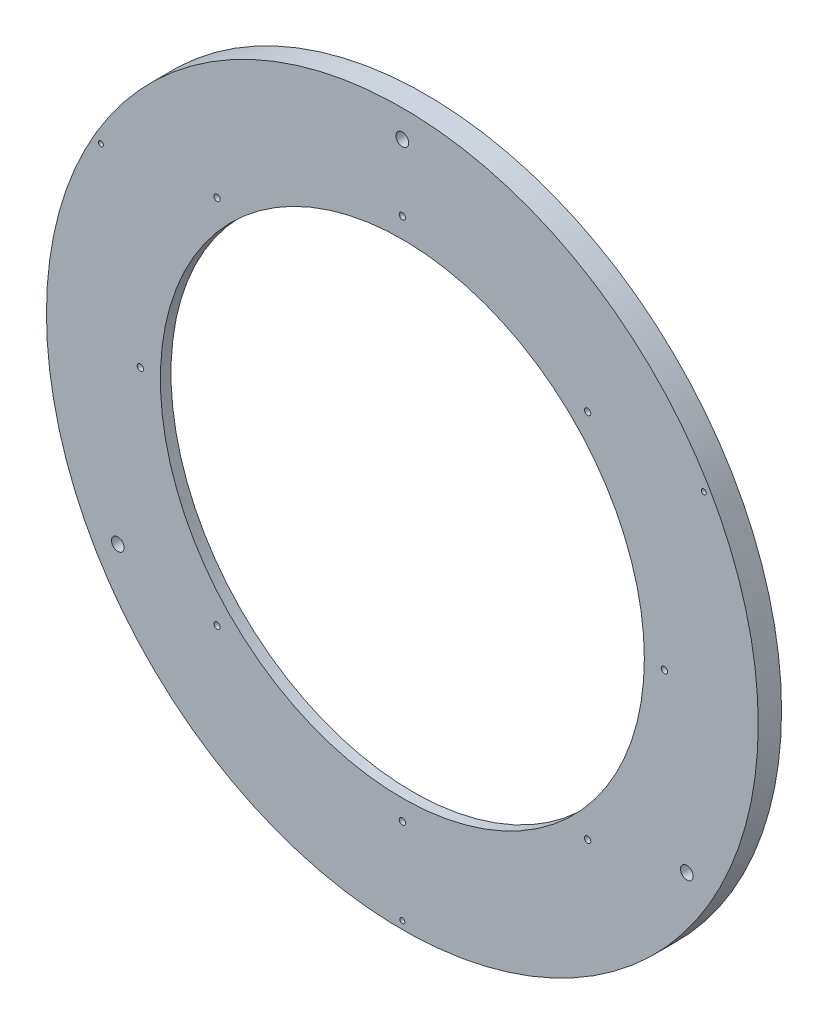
ISO-10303-21;
HEADER;
FILE_DESCRIPTION(('STEP AP214'),'2;1');
FILE_NAME('part.step','',(''),(''),'','','');
FILE_SCHEMA(('AUTOMOTIVE_DESIGN { 1 0 10303 214 1 1 1 1 }'));
ENDSEC;
DATA;
#1=APPLICATION_CONTEXT('core data for automotive mechanical design processes');
#2=APPLICATION_PROTOCOL_DEFINITION('international standard','automotive_design',2000,#1);
#3=PRODUCT_CONTEXT('',#1,'mechanical');
#4=PRODUCT('Part','Part','',(#3));
#5=PRODUCT_RELATED_PRODUCT_CATEGORY('part','',(#4));
#6=PRODUCT_DEFINITION_FORMATION('','',#4);
#7=PRODUCT_DEFINITION_CONTEXT('part definition',#1,'design');
#8=PRODUCT_DEFINITION('design','',#6,#7);
#9=PRODUCT_DEFINITION_SHAPE('','',#8);
#10=(LENGTH_UNIT() NAMED_UNIT(*) SI_UNIT(.MILLI.,.METRE.));
#11=(NAMED_UNIT(*) PLANE_ANGLE_UNIT() SI_UNIT($,.RADIAN.));
#12=(NAMED_UNIT(*) SI_UNIT($,.STERADIAN.) SOLID_ANGLE_UNIT());
#13=UNCERTAINTY_MEASURE_WITH_UNIT(LENGTH_MEASURE(1.E-05),#10,'distance_accuracy_value','');
#14=(GEOMETRIC_REPRESENTATION_CONTEXT(3) GLOBAL_UNCERTAINTY_ASSIGNED_CONTEXT((#13)) GLOBAL_UNIT_ASSIGNED_CONTEXT((#10,
#11,#12)) REPRESENTATION_CONTEXT('',''));
#15=CARTESIAN_POINT('',(0.,0.,0.));
#16=DIRECTION('',(0.,0.,1.));
#17=DIRECTION('',(1.,0.,0.));
#18=AXIS2_PLACEMENT_3D('',#15,#16,#17);
#19=CARTESIAN_POINT('',(0.,0.,0.));
#20=DIRECTION('',(0.,0.,1.));
#21=DIRECTION('',(1.,0.,0.));
#22=AXIS2_PLACEMENT_3D('',#19,#20,#21);
#23=CYLINDRICAL_SURFACE('',#22,196.453125);
#24=CARTESIAN_POINT('',(0.,0.,0.));
#25=DIRECTION('',(0.,0.,1.));
#26=DIRECTION('',(1.,0.,0.));
#27=AXIS2_PLACEMENT_3D('',#24,#25,#26);
#28=CIRCLE('',#27,196.453125);
#29=CARTESIAN_POINT('',(196.453125,0.,0.));
#30=VERTEX_POINT('',#29);
#31=EDGE_CURVE('E10',#30,#30,#28,.T.);
#32=ORIENTED_EDGE('',*,*,#31,.T.);
#33=EDGE_LOOP('',(#32));
#34=FACE_BOUND('',#33,.T.);
#35=CARTESIAN_POINT('',(0.,0.,-8.636));
#36=DIRECTION('',(0.,0.,1.));
#37=DIRECTION('',(1.,0.,0.));
#38=AXIS2_PLACEMENT_3D('',#35,#36,#37);
#39=CIRCLE('',#38,196.453125);
#40=CARTESIAN_POINT('',(196.453125,0.,-8.636));
#41=VERTEX_POINT('',#40);
#42=EDGE_CURVE('E61',#41,#41,#39,.T.);
#43=ORIENTED_EDGE('',*,*,#42,.F.);
#44=EDGE_LOOP('',(#43));
#45=FACE_BOUND('',#44,.T.);
#46=ADVANCED_FACE('F33',(#34,#45),#23,.F.);
#47=CARTESIAN_POINT('',(196.453125,0.,0.));
#48=DIRECTION('',(0.,0.,1.));
#49=DIRECTION('',(1.,0.,0.));
#50=AXIS2_PLACEMENT_3D('',#47,#48,#49);
#51=PLANE('',#50);
#52=CARTESIAN_POINT('',(0.,-282.575,0.));
#53=DIRECTION('',(0.,0.,-1.));
#54=DIRECTION('',(-1.,0.,0.));
#55=AXIS2_PLACEMENT_3D('',#52,#53,#54);
#56=CIRCLE('',#55,2.0193);
#57=CARTESIAN_POINT('',(-2.0193,-282.575,0.));
#58=VERTEX_POINT('',#57);
#59=EDGE_CURVE('E142',#58,#58,#56,.T.);
#60=ORIENTED_EDGE('',*,*,#59,.T.);
#61=EDGE_LOOP('',(#60));
#62=FACE_BOUND('',#61,.T.);
#63=CARTESIAN_POINT('',(-244.717128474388,141.287499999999,0.));
#64=DIRECTION('',(0.,0.,-1.));
#65=DIRECTION('',(-1.,0.,0.));
#66=AXIS2_PLACEMENT_3D('',#63,#64,#65);
#67=CIRCLE('',#66,2.0193);
#68=CARTESIAN_POINT('',(-246.736428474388,141.287499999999,0.));
#69=VERTEX_POINT('',#68);
#70=EDGE_CURVE('E136',#69,#69,#67,.T.);
#71=ORIENTED_EDGE('',*,*,#70,.T.);
#72=EDGE_LOOP('',(#71));
#73=FACE_BOUND('',#72,.T.);
#74=CARTESIAN_POINT('',(244.717128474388,141.287499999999,0.));
#75=DIRECTION('',(0.,0.,-1.));
#76=DIRECTION('',(-1.,0.,0.));
#77=AXIS2_PLACEMENT_3D('',#74,#75,#76);
#78=CIRCLE('',#77,2.0193);
#79=CARTESIAN_POINT('',(242.697828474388,141.287499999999,0.));
#80=VERTEX_POINT('',#79);
#81=EDGE_CURVE('E130',#80,#80,#78,.T.);
#82=ORIENTED_EDGE('',*,*,#81,.T.);
#83=EDGE_LOOP('',(#82));
#84=FACE_BOUND('',#83,.T.);
#85=CARTESIAN_POINT('',(0.,266.7,0.));
#86=DIRECTION('',(0.,0.,-1.));
#87=DIRECTION('',(-1.,0.,0.));
#88=AXIS2_PLACEMENT_3D('',#85,#86,#87);
#89=CIRCLE('',#88,5.15873999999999);
#90=CARTESIAN_POINT('',(-5.15873999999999,266.7,0.));
#91=VERTEX_POINT('',#90);
#92=EDGE_CURVE('E124',#91,#91,#89,.T.);
#93=ORIENTED_EDGE('',*,*,#92,.T.);
#94=EDGE_LOOP('',(#93));
#95=FACE_BOUND('',#94,.T.);
#96=CARTESIAN_POINT('',(-230.96897518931,-133.349999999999,0.));
#97=DIRECTION('',(0.,0.,-1.));
#98=DIRECTION('',(-1.,0.,0.));
#99=AXIS2_PLACEMENT_3D('',#96,#97,#98);
#100=CIRCLE('',#99,5.15873999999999);
#101=CARTESIAN_POINT('',(-236.12771518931,-133.349999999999,0.));
#102=VERTEX_POINT('',#101);
#103=EDGE_CURVE('E118',#102,#102,#100,.T.);
#104=ORIENTED_EDGE('',*,*,#103,.T.);
#105=EDGE_LOOP('',(#104));
#106=FACE_BOUND('',#105,.T.);
#107=CARTESIAN_POINT('',(230.96897518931,-133.349999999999,0.));
#108=DIRECTION('',(0.,0.,-1.));
#109=DIRECTION('',(-1.,0.,0.));
#110=AXIS2_PLACEMENT_3D('',#107,#108,#109);
#111=CIRCLE('',#110,5.15873999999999);
#112=CARTESIAN_POINT('',(225.81023518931,-133.349999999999,0.));
#113=VERTEX_POINT('',#112);
#114=EDGE_CURVE('E112',#113,#113,#111,.T.);
#115=ORIENTED_EDGE('',*,*,#114,.T.);
#116=EDGE_LOOP('',(#115));
#117=FACE_BOUND('',#116,.T.);
#118=CARTESIAN_POINT('',(150.419290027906,150.41929002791,0.));
#119=DIRECTION('',(0.,0.,-1.));
#120=DIRECTION('',(-1.,0.,0.));
#121=AXIS2_PLACEMENT_3D('',#118,#119,#120);
#122=CIRCLE('',#121,2.55269999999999);
#123=CARTESIAN_POINT('',(147.866590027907,150.41929002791,0.));
#124=VERTEX_POINT('',#123);
#125=EDGE_CURVE('E106',#124,#124,#122,.T.);
#126=ORIENTED_EDGE('',*,*,#125,.T.);
#127=EDGE_LOOP('',(#126));
#128=FACE_BOUND('',#127,.T.);
#129=CARTESIAN_POINT('',(212.725,2.22817610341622E-12,0.));
#130=DIRECTION('',(0.,0.,-1.));
#131=DIRECTION('',(-1.,0.,0.));
#132=AXIS2_PLACEMENT_3D('',#129,#130,#131);
#133=CIRCLE('',#132,2.55269999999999);
#134=CARTESIAN_POINT('',(210.1723,2.22817610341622E-12,0.));
#135=VERTEX_POINT('',#134);
#136=EDGE_CURVE('E100',#135,#135,#133,.T.);
#137=ORIENTED_EDGE('',*,*,#136,.T.);
#138=EDGE_LOOP('',(#137));
#139=FACE_BOUND('',#138,.T.);
#140=CARTESIAN_POINT('',(150.41929002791,-150.419290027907,0.));
#141=DIRECTION('',(0.,0.,-1.));
#142=DIRECTION('',(-1.,0.,0.));
#143=AXIS2_PLACEMENT_3D('',#140,#141,#142);
#144=CIRCLE('',#143,2.55269999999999);
#145=CARTESIAN_POINT('',(147.86659002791,-150.419290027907,0.));
#146=VERTEX_POINT('',#145);
#147=EDGE_CURVE('E94',#146,#146,#144,.T.);
#148=ORIENTED_EDGE('',*,*,#147,.T.);
#149=EDGE_LOOP('',(#148));
#150=FACE_BOUND('',#149,.T.);
#151=CARTESIAN_POINT('',(0.,-212.725,0.));
#152=DIRECTION('',(0.,0.,-1.));
#153=DIRECTION('',(-1.,0.,0.));
#154=AXIS2_PLACEMENT_3D('',#151,#152,#153);
#155=CIRCLE('',#154,2.5527);
#156=CARTESIAN_POINT('',(-2.5527,-212.725,0.));
#157=VERTEX_POINT('',#156);
#158=EDGE_CURVE('E88',#157,#157,#155,.T.);
#159=ORIENTED_EDGE('',*,*,#158,.T.);
#160=EDGE_LOOP('',(#159));
#161=FACE_BOUND('',#160,.T.);
#162=CARTESIAN_POINT('',(-150.419290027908,-150.419290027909,0.));
#163=DIRECTION('',(0.,0.,-1.));
#164=DIRECTION('',(-1.,0.,0.));
#165=AXIS2_PLACEMENT_3D('',#162,#163,#164);
#166=CIRCLE('',#165,2.55269999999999);
#167=CARTESIAN_POINT('',(-152.971990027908,-150.419290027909,0.));
#168=VERTEX_POINT('',#167);
#169=EDGE_CURVE('E82',#168,#168,#166,.T.);
#170=ORIENTED_EDGE('',*,*,#169,.T.);
#171=EDGE_LOOP('',(#170));
#172=FACE_BOUND('',#171,.T.);
#173=CARTESIAN_POINT('',(-212.725,-7.42725367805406E-13,0.));
#174=DIRECTION('',(0.,0.,-1.));
#175=DIRECTION('',(-1.,0.,0.));
#176=AXIS2_PLACEMENT_3D('',#173,#174,#175);
#177=CIRCLE('',#176,2.55269999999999);
#178=CARTESIAN_POINT('',(-215.2777,-7.42725367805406E-13,0.));
#179=VERTEX_POINT('',#178);
#180=EDGE_CURVE('E76',#179,#179,#177,.T.);
#181=ORIENTED_EDGE('',*,*,#180,.T.);
#182=EDGE_LOOP('',(#181));
#183=FACE_BOUND('',#182,.T.);
#184=CARTESIAN_POINT('',(-150.419290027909,150.419290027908,0.));
#185=DIRECTION('',(0.,0.,-1.));
#186=DIRECTION('',(-1.,0.,0.));
#187=AXIS2_PLACEMENT_3D('',#184,#185,#186);
#188=CIRCLE('',#187,2.55269999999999);
#189=CARTESIAN_POINT('',(-152.971990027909,150.419290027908,0.));
#190=VERTEX_POINT('',#189);
#191=EDGE_CURVE('E70',#190,#190,#188,.T.);
#192=ORIENTED_EDGE('',*,*,#191,.T.);
#193=EDGE_LOOP('',(#192));
#194=FACE_BOUND('',#193,.T.);
#195=CARTESIAN_POINT('',(0.,212.725,0.));
#196=DIRECTION('',(0.,0.,-1.));
#197=DIRECTION('',(-1.,0.,0.));
#198=AXIS2_PLACEMENT_3D('',#195,#196,#197);
#199=CIRCLE('',#198,2.5527);
#200=CARTESIAN_POINT('',(-2.5527,212.725,0.));
#201=VERTEX_POINT('',#200);
#202=EDGE_CURVE('E64',#201,#201,#199,.T.);
#203=ORIENTED_EDGE('',*,*,#202,.T.);
#204=EDGE_LOOP('',(#203));
#205=FACE_BOUND('',#204,.T.);
#206=CARTESIAN_POINT('',(0.,0.,0.));
#207=DIRECTION('',(0.,0.,1.));
#208=DIRECTION('',(1.,0.,0.));
#209=AXIS2_PLACEMENT_3D('',#206,#207,#208);
#210=CIRCLE('',#209,288.925);
#211=CARTESIAN_POINT('',(288.925,0.,0.));
#212=VERTEX_POINT('',#211);
#213=EDGE_CURVE('E39',#212,#212,#210,.T.);
#214=ORIENTED_EDGE('',*,*,#213,.T.);
#215=EDGE_LOOP('',(#214));
#216=FACE_BOUND('',#215,.T.);
#217=ORIENTED_EDGE('',*,*,#31,.F.);
#218=EDGE_LOOP('',(#217));
#219=FACE_BOUND('',#218,.T.);
#220=ADVANCED_FACE('F167',(#62,#73,#84,#95,#106,#117,#128,#139,#150,#161,#172,#183,#194,#205,
#216,#219),#51,.T.);
#221=CARTESIAN_POINT('',(0.,0.,0.));
#222=DIRECTION('',(0.,0.,1.));
#223=DIRECTION('',(1.,0.,0.));
#224=AXIS2_PLACEMENT_3D('',#221,#222,#223);
#225=CYLINDRICAL_SURFACE('',#224,288.925);
#226=CARTESIAN_POINT('',(0.,0.,-18.923));
#227=DIRECTION('',(0.,0.,1.));
#228=DIRECTION('',(1.,0.,0.));
#229=AXIS2_PLACEMENT_3D('',#226,#227,#228);
#230=CIRCLE('',#229,288.925);
#231=CARTESIAN_POINT('',(288.925,0.,-18.923));
#232=VERTEX_POINT('',#231);
#233=EDGE_CURVE('E43',#232,#232,#230,.T.);
#234=ORIENTED_EDGE('',*,*,#233,.T.);
#235=EDGE_LOOP('',(#234));
#236=FACE_BOUND('',#235,.T.);
#237=ORIENTED_EDGE('',*,*,#213,.F.);
#238=EDGE_LOOP('',(#237));
#239=FACE_BOUND('',#238,.T.);
#240=ADVANCED_FACE('F155',(#236,#239),#225,.T.);
#241=CARTESIAN_POINT('',(288.925,0.,-18.923));
#242=DIRECTION('',(0.,0.,-1.));
#243=DIRECTION('',(-1.,0.,0.));
#244=AXIS2_PLACEMENT_3D('',#241,#242,#243);
#245=PLANE('',#244);
#246=CARTESIAN_POINT('',(0.,-282.575,-18.923));
#247=DIRECTION('',(0.,0.,-1.));
#248=DIRECTION('',(-1.,0.,0.));
#249=AXIS2_PLACEMENT_3D('',#246,#247,#248);
#250=CIRCLE('',#249,2.01929999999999);
#251=CARTESIAN_POINT('',(-2.01929999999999,-282.575,-18.923));
#252=VERTEX_POINT('',#251);
#253=EDGE_CURVE('E145',#252,#252,#250,.T.);
#254=ORIENTED_EDGE('',*,*,#253,.F.);
#255=EDGE_LOOP('',(#254));
#256=FACE_BOUND('',#255,.T.);
#257=CARTESIAN_POINT('',(-244.717128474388,141.287499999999,-18.923));
#258=DIRECTION('',(0.,0.,-1.));
#259=DIRECTION('',(-1.,0.,0.));
#260=AXIS2_PLACEMENT_3D('',#257,#258,#259);
#261=CIRCLE('',#260,2.01929999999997);
#262=CARTESIAN_POINT('',(-246.736428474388,141.287499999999,-18.923));
#263=VERTEX_POINT('',#262);
#264=EDGE_CURVE('E139',#263,#263,#261,.T.);
#265=ORIENTED_EDGE('',*,*,#264,.F.);
#266=EDGE_LOOP('',(#265));
#267=FACE_BOUND('',#266,.T.);
#268=CARTESIAN_POINT('',(244.717128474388,141.287499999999,-18.923));
#269=DIRECTION('',(0.,0.,-1.));
#270=DIRECTION('',(-1.,0.,0.));
#271=AXIS2_PLACEMENT_3D('',#268,#269,#270);
#272=CIRCLE('',#271,2.01929999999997);
#273=CARTESIAN_POINT('',(242.697828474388,141.287499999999,-18.923));
#274=VERTEX_POINT('',#273);
#275=EDGE_CURVE('E133',#274,#274,#272,.T.);
#276=ORIENTED_EDGE('',*,*,#275,.F.);
#277=EDGE_LOOP('',(#276));
#278=FACE_BOUND('',#277,.T.);
#279=CARTESIAN_POINT('',(0.,0.,-18.923));
#280=DIRECTION('',(0.,0.,1.));
#281=DIRECTION('',(1.,0.,0.));
#282=AXIS2_PLACEMENT_3D('',#279,#280,#281);
#283=CIRCLE('',#282,276.225);
#284=CARTESIAN_POINT('',(276.225,0.,-18.923));
#285=VERTEX_POINT('',#284);
#286=EDGE_CURVE('E47',#285,#285,#283,.T.);
#287=ORIENTED_EDGE('',*,*,#286,.T.);
#288=EDGE_LOOP('',(#287));
#289=FACE_BOUND('',#288,.T.);
#290=ORIENTED_EDGE('',*,*,#233,.F.);
#291=EDGE_LOOP('',(#290));
#292=FACE_BOUND('',#291,.T.);
#293=ADVANCED_FACE('F151',(#256,#267,#278,#289,#292),#245,.T.);
#294=CARTESIAN_POINT('',(0.,0.,0.));
#295=DIRECTION('',(0.,0.,1.));
#296=DIRECTION('',(1.,0.,0.));
#297=AXIS2_PLACEMENT_3D('',#294,#295,#296);
#298=CYLINDRICAL_SURFACE('',#297,276.225);
#299=CARTESIAN_POINT('',(0.,0.,-25.146));
#300=DIRECTION('',(0.,0.,1.));
#301=DIRECTION('',(1.,0.,0.));
#302=AXIS2_PLACEMENT_3D('',#299,#300,#301);
#303=CIRCLE('',#302,276.225);
#304=CARTESIAN_POINT('',(276.225,0.,-25.146));
#305=VERTEX_POINT('',#304);
#306=EDGE_CURVE('E52',#305,#305,#303,.T.);
#307=ORIENTED_EDGE('',*,*,#306,.T.);
#308=EDGE_LOOP('',(#307));
#309=FACE_BOUND('',#308,.T.);
#310=ORIENTED_EDGE('',*,*,#286,.F.);
#311=EDGE_LOOP('',(#310));
#312=FACE_BOUND('',#311,.T.);
#313=ADVANCED_FACE('F154',(#309,#312),#298,.T.);
#314=CARTESIAN_POINT('',(276.225,0.,-25.146));
#315=DIRECTION('',(0.,0.,-1.));
#316=DIRECTION('',(-1.,0.,0.));
#317=AXIS2_PLACEMENT_3D('',#314,#315,#316);
#318=PLANE('',#317);
#319=CARTESIAN_POINT('',(0.,266.7,-25.146));
#320=DIRECTION('',(0.,0.,-1.));
#321=DIRECTION('',(-1.,0.,0.));
#322=AXIS2_PLACEMENT_3D('',#319,#320,#321);
#323=CIRCLE('',#322,5.15873999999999);
#324=CARTESIAN_POINT('',(-5.15873999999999,266.7,-25.146));
#325=VERTEX_POINT('',#324);
#326=EDGE_CURVE('E127',#325,#325,#323,.T.);
#327=ORIENTED_EDGE('',*,*,#326,.F.);
#328=EDGE_LOOP('',(#327));
#329=FACE_BOUND('',#328,.T.);
#330=CARTESIAN_POINT('',(-230.96897518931,-133.349999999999,-25.146));
#331=DIRECTION('',(0.,0.,-1.));
#332=DIRECTION('',(-1.,0.,0.));
#333=AXIS2_PLACEMENT_3D('',#330,#331,#332);
#334=CIRCLE('',#333,5.15873999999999);
#335=CARTESIAN_POINT('',(-236.12771518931,-133.349999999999,-25.146));
#336=VERTEX_POINT('',#335);
#337=EDGE_CURVE('E121',#336,#336,#334,.T.);
#338=ORIENTED_EDGE('',*,*,#337,.F.);
#339=EDGE_LOOP('',(#338));
#340=FACE_BOUND('',#339,.T.);
#341=CARTESIAN_POINT('',(230.96897518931,-133.349999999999,-25.146));
#342=DIRECTION('',(0.,0.,-1.));
#343=DIRECTION('',(-1.,0.,0.));
#344=AXIS2_PLACEMENT_3D('',#341,#342,#343);
#345=CIRCLE('',#344,5.15873999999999);
#346=CARTESIAN_POINT('',(225.81023518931,-133.349999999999,-25.146));
#347=VERTEX_POINT('',#346);
#348=EDGE_CURVE('E115',#347,#347,#345,.T.);
#349=ORIENTED_EDGE('',*,*,#348,.F.);
#350=EDGE_LOOP('',(#349));
#351=FACE_BOUND('',#350,.T.);
#352=CARTESIAN_POINT('',(0.,0.,-25.146));
#353=DIRECTION('',(0.,0.,1.));
#354=DIRECTION('',(1.,0.,0.));
#355=AXIS2_PLACEMENT_3D('',#352,#353,#354);
#356=CIRCLE('',#355,222.25);
#357=CARTESIAN_POINT('',(222.25,0.,-25.146));
#358=VERTEX_POINT('',#357);
#359=EDGE_CURVE('E55',#358,#358,#356,.T.);
#360=ORIENTED_EDGE('',*,*,#359,.T.);
#361=EDGE_LOOP('',(#360));
#362=FACE_BOUND('',#361,.T.);
#363=ORIENTED_EDGE('',*,*,#306,.F.);
#364=EDGE_LOOP('',(#363));
#365=FACE_BOUND('',#364,.T.);
#366=ADVANCED_FACE('F190',(#329,#340,#351,#362,#365),#318,.T.);
#367=CARTESIAN_POINT('',(0.,0.,0.));
#368=DIRECTION('',(0.,0.,1.));
#369=DIRECTION('',(1.,0.,0.));
#370=AXIS2_PLACEMENT_3D('',#367,#368,#369);
#371=CYLINDRICAL_SURFACE('',#370,222.25);
#372=CARTESIAN_POINT('',(0.,0.,-8.636));
#373=DIRECTION('',(0.,0.,1.));
#374=DIRECTION('',(1.,0.,0.));
#375=AXIS2_PLACEMENT_3D('',#372,#373,#374);
#376=CIRCLE('',#375,222.25);
#377=CARTESIAN_POINT('',(222.25,0.,-8.636));
#378=VERTEX_POINT('',#377);
#379=EDGE_CURVE('E58',#378,#378,#376,.T.);
#380=ORIENTED_EDGE('',*,*,#379,.T.);
#381=EDGE_LOOP('',(#380));
#382=FACE_BOUND('',#381,.T.);
#383=ORIENTED_EDGE('',*,*,#359,.F.);
#384=EDGE_LOOP('',(#383));
#385=FACE_BOUND('',#384,.T.);
#386=ADVANCED_FACE('F183',(#382,#385),#371,.F.);
#387=CARTESIAN_POINT('',(222.25,0.,-8.636));
#388=DIRECTION('',(0.,0.,-1.));
#389=DIRECTION('',(-1.,0.,0.));
#390=AXIS2_PLACEMENT_3D('',#387,#388,#389);
#391=PLANE('',#390);
#392=CARTESIAN_POINT('',(150.419290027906,150.41929002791,-8.636));
#393=DIRECTION('',(0.,0.,-1.));
#394=DIRECTION('',(-1.,0.,0.));
#395=AXIS2_PLACEMENT_3D('',#392,#393,#394);
#396=CIRCLE('',#395,2.55269999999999);
#397=CARTESIAN_POINT('',(147.866590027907,150.41929002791,-8.636));
#398=VERTEX_POINT('',#397);
#399=EDGE_CURVE('E109',#398,#398,#396,.T.);
#400=ORIENTED_EDGE('',*,*,#399,.F.);
#401=EDGE_LOOP('',(#400));
#402=FACE_BOUND('',#401,.T.);
#403=CARTESIAN_POINT('',(212.725,2.22817610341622E-12,-8.636));
#404=DIRECTION('',(0.,0.,-1.));
#405=DIRECTION('',(-1.,0.,0.));
#406=AXIS2_PLACEMENT_3D('',#403,#404,#405);
#407=CIRCLE('',#406,2.55269999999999);
#408=CARTESIAN_POINT('',(210.1723,2.22817610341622E-12,-8.636));
#409=VERTEX_POINT('',#408);
#410=EDGE_CURVE('E103',#409,#409,#407,.T.);
#411=ORIENTED_EDGE('',*,*,#410,.F.);
#412=EDGE_LOOP('',(#411));
#413=FACE_BOUND('',#412,.T.);
#414=CARTESIAN_POINT('',(150.41929002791,-150.419290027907,-8.636));
#415=DIRECTION('',(0.,0.,-1.));
#416=DIRECTION('',(-1.,0.,0.));
#417=AXIS2_PLACEMENT_3D('',#414,#415,#416);
#418=CIRCLE('',#417,2.55269999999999);
#419=CARTESIAN_POINT('',(147.86659002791,-150.419290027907,-8.636));
#420=VERTEX_POINT('',#419);
#421=EDGE_CURVE('E97',#420,#420,#418,.T.);
#422=ORIENTED_EDGE('',*,*,#421,.F.);
#423=EDGE_LOOP('',(#422));
#424=FACE_BOUND('',#423,.T.);
#425=CARTESIAN_POINT('',(0.,-212.725,-8.636));
#426=DIRECTION('',(0.,0.,-1.));
#427=DIRECTION('',(-1.,0.,0.));
#428=AXIS2_PLACEMENT_3D('',#425,#426,#427);
#429=CIRCLE('',#428,2.55269999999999);
#430=CARTESIAN_POINT('',(-2.55269999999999,-212.725,-8.636));
#431=VERTEX_POINT('',#430);
#432=EDGE_CURVE('E91',#431,#431,#429,.T.);
#433=ORIENTED_EDGE('',*,*,#432,.F.);
#434=EDGE_LOOP('',(#433));
#435=FACE_BOUND('',#434,.T.);
#436=CARTESIAN_POINT('',(-150.419290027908,-150.419290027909,-8.636));
#437=DIRECTION('',(0.,0.,-1.));
#438=DIRECTION('',(-1.,0.,0.));
#439=AXIS2_PLACEMENT_3D('',#436,#437,#438);
#440=CIRCLE('',#439,2.55269999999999);
#441=CARTESIAN_POINT('',(-152.971990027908,-150.419290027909,-8.636));
#442=VERTEX_POINT('',#441);
#443=EDGE_CURVE('E85',#442,#442,#440,.T.);
#444=ORIENTED_EDGE('',*,*,#443,.F.);
#445=EDGE_LOOP('',(#444));
#446=FACE_BOUND('',#445,.T.);
#447=CARTESIAN_POINT('',(-212.725,-7.42725367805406E-13,-8.636));
#448=DIRECTION('',(0.,0.,-1.));
#449=DIRECTION('',(-1.,0.,0.));
#450=AXIS2_PLACEMENT_3D('',#447,#448,#449);
#451=CIRCLE('',#450,2.55269999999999);
#452=CARTESIAN_POINT('',(-215.2777,-7.42725367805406E-13,-8.636));
#453=VERTEX_POINT('',#452);
#454=EDGE_CURVE('E79',#453,#453,#451,.T.);
#455=ORIENTED_EDGE('',*,*,#454,.F.);
#456=EDGE_LOOP('',(#455));
#457=FACE_BOUND('',#456,.T.);
#458=CARTESIAN_POINT('',(-150.419290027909,150.419290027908,-8.636));
#459=DIRECTION('',(0.,0.,-1.));
#460=DIRECTION('',(-1.,0.,0.));
#461=AXIS2_PLACEMENT_3D('',#458,#459,#460);
#462=CIRCLE('',#461,2.55269999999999);
#463=CARTESIAN_POINT('',(-152.971990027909,150.419290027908,-8.636));
#464=VERTEX_POINT('',#463);
#465=EDGE_CURVE('E73',#464,#464,#462,.T.);
#466=ORIENTED_EDGE('',*,*,#465,.F.);
#467=EDGE_LOOP('',(#466));
#468=FACE_BOUND('',#467,.T.);
#469=CARTESIAN_POINT('',(0.,212.725,-8.636));
#470=DIRECTION('',(0.,0.,-1.));
#471=DIRECTION('',(-1.,0.,0.));
#472=AXIS2_PLACEMENT_3D('',#469,#470,#471);
#473=CIRCLE('',#472,2.55269999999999);
#474=CARTESIAN_POINT('',(-2.55269999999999,212.725,-8.636));
#475=VERTEX_POINT('',#474);
#476=EDGE_CURVE('E67',#475,#475,#473,.T.);
#477=ORIENTED_EDGE('',*,*,#476,.F.);
#478=EDGE_LOOP('',(#477));
#479=FACE_BOUND('',#478,.T.);
#480=ORIENTED_EDGE('',*,*,#42,.T.);
#481=EDGE_LOOP('',(#480));
#482=FACE_BOUND('',#481,.T.);
#483=ORIENTED_EDGE('',*,*,#379,.F.);
#484=EDGE_LOOP('',(#483));
#485=FACE_BOUND('',#484,.T.);
#486=ADVANCED_FACE('F179',(#402,#413,#424,#435,#446,#457,#468,#479,#482,#485),#391,.T.);
#487=CARTESIAN_POINT('',(0.,212.725,-8.636));
#488=DIRECTION('',(0.,0.,-1.));
#489=DIRECTION('',(-1.,0.,0.));
#490=AXIS2_PLACEMENT_3D('',#487,#488,#489);
#491=CYLINDRICAL_SURFACE('',#490,2.55269999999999);
#492=ORIENTED_EDGE('',*,*,#202,.F.);
#493=EDGE_LOOP('',(#492));
#494=FACE_BOUND('',#493,.T.);
#495=ORIENTED_EDGE('',*,*,#476,.T.);
#496=EDGE_LOOP('',(#495));
#497=FACE_BOUND('',#496,.T.);
#498=ADVANCED_FACE('F182',(#494,#497),#491,.F.);
#499=CARTESIAN_POINT('',(-150.419290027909,150.419290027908,-8.636));
#500=DIRECTION('',(0.,0.,-1.));
#501=DIRECTION('',(-1.,0.,0.));
#502=AXIS2_PLACEMENT_3D('',#499,#500,#501);
#503=CYLINDRICAL_SURFACE('',#502,2.55269999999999);
#504=ORIENTED_EDGE('',*,*,#191,.F.);
#505=EDGE_LOOP('',(#504));
#506=FACE_BOUND('',#505,.T.);
#507=ORIENTED_EDGE('',*,*,#465,.T.);
#508=EDGE_LOOP('',(#507));
#509=FACE_BOUND('',#508,.T.);
#510=ADVANCED_FACE('F208',(#506,#509),#503,.F.);
#511=CARTESIAN_POINT('',(-212.725,-7.42725367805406E-13,-8.636));
#512=DIRECTION('',(0.,0.,-1.));
#513=DIRECTION('',(-1.,0.,0.));
#514=AXIS2_PLACEMENT_3D('',#511,#512,#513);
#515=CYLINDRICAL_SURFACE('',#514,2.55269999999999);
#516=ORIENTED_EDGE('',*,*,#180,.F.);
#517=EDGE_LOOP('',(#516));
#518=FACE_BOUND('',#517,.T.);
#519=ORIENTED_EDGE('',*,*,#454,.T.);
#520=EDGE_LOOP('',(#519));
#521=FACE_BOUND('',#520,.T.);
#522=ADVANCED_FACE('F212',(#518,#521),#515,.F.);
#523=CARTESIAN_POINT('',(-150.419290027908,-150.419290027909,-8.636));
#524=DIRECTION('',(0.,0.,-1.));
#525=DIRECTION('',(-1.,0.,0.));
#526=AXIS2_PLACEMENT_3D('',#523,#524,#525);
#527=CYLINDRICAL_SURFACE('',#526,2.55269999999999);
#528=ORIENTED_EDGE('',*,*,#169,.F.);
#529=EDGE_LOOP('',(#528));
#530=FACE_BOUND('',#529,.T.);
#531=ORIENTED_EDGE('',*,*,#443,.T.);
#532=EDGE_LOOP('',(#531));
#533=FACE_BOUND('',#532,.T.);
#534=ADVANCED_FACE('F216',(#530,#533),#527,.F.);
#535=CARTESIAN_POINT('',(0.,-212.725,-8.636));
#536=DIRECTION('',(0.,0.,-1.));
#537=DIRECTION('',(-1.,0.,0.));
#538=AXIS2_PLACEMENT_3D('',#535,#536,#537);
#539=CYLINDRICAL_SURFACE('',#538,2.55269999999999);
#540=ORIENTED_EDGE('',*,*,#158,.F.);
#541=EDGE_LOOP('',(#540));
#542=FACE_BOUND('',#541,.T.);
#543=ORIENTED_EDGE('',*,*,#432,.T.);
#544=EDGE_LOOP('',(#543));
#545=FACE_BOUND('',#544,.T.);
#546=ADVANCED_FACE('F220',(#542,#545),#539,.F.);
#547=CARTESIAN_POINT('',(150.41929002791,-150.419290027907,-8.636));
#548=DIRECTION('',(0.,0.,-1.));
#549=DIRECTION('',(-1.,0.,0.));
#550=AXIS2_PLACEMENT_3D('',#547,#548,#549);
#551=CYLINDRICAL_SURFACE('',#550,2.55269999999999);
#552=ORIENTED_EDGE('',*,*,#147,.F.);
#553=EDGE_LOOP('',(#552));
#554=FACE_BOUND('',#553,.T.);
#555=ORIENTED_EDGE('',*,*,#421,.T.);
#556=EDGE_LOOP('',(#555));
#557=FACE_BOUND('',#556,.T.);
#558=ADVANCED_FACE('F224',(#554,#557),#551,.F.);
#559=CARTESIAN_POINT('',(212.725,2.22817610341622E-12,-8.636));
#560=DIRECTION('',(0.,0.,-1.));
#561=DIRECTION('',(-1.,0.,0.));
#562=AXIS2_PLACEMENT_3D('',#559,#560,#561);
#563=CYLINDRICAL_SURFACE('',#562,2.55269999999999);
#564=ORIENTED_EDGE('',*,*,#136,.F.);
#565=EDGE_LOOP('',(#564));
#566=FACE_BOUND('',#565,.T.);
#567=ORIENTED_EDGE('',*,*,#410,.T.);
#568=EDGE_LOOP('',(#567));
#569=FACE_BOUND('',#568,.T.);
#570=ADVANCED_FACE('F228',(#566,#569),#563,.F.);
#571=CARTESIAN_POINT('',(150.419290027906,150.41929002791,-8.636));
#572=DIRECTION('',(0.,0.,-1.));
#573=DIRECTION('',(-1.,0.,0.));
#574=AXIS2_PLACEMENT_3D('',#571,#572,#573);
#575=CYLINDRICAL_SURFACE('',#574,2.55269999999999);
#576=ORIENTED_EDGE('',*,*,#125,.F.);
#577=EDGE_LOOP('',(#576));
#578=FACE_BOUND('',#577,.T.);
#579=ORIENTED_EDGE('',*,*,#399,.T.);
#580=EDGE_LOOP('',(#579));
#581=FACE_BOUND('',#580,.T.);
#582=ADVANCED_FACE('F232',(#578,#581),#575,.F.);
#583=CARTESIAN_POINT('',(230.96897518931,-133.349999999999,-25.146));
#584=DIRECTION('',(0.,0.,-1.));
#585=DIRECTION('',(-1.,0.,0.));
#586=AXIS2_PLACEMENT_3D('',#583,#584,#585);
#587=CYLINDRICAL_SURFACE('',#586,5.15873999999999);
#588=ORIENTED_EDGE('',*,*,#114,.F.);
#589=EDGE_LOOP('',(#588));
#590=FACE_BOUND('',#589,.T.);
#591=ORIENTED_EDGE('',*,*,#348,.T.);
#592=EDGE_LOOP('',(#591));
#593=FACE_BOUND('',#592,.T.);
#594=ADVANCED_FACE('F236',(#590,#593),#587,.F.);
#595=CARTESIAN_POINT('',(-230.96897518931,-133.349999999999,-25.146));
#596=DIRECTION('',(0.,0.,-1.));
#597=DIRECTION('',(-1.,0.,0.));
#598=AXIS2_PLACEMENT_3D('',#595,#596,#597);
#599=CYLINDRICAL_SURFACE('',#598,5.15873999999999);
#600=ORIENTED_EDGE('',*,*,#103,.F.);
#601=EDGE_LOOP('',(#600));
#602=FACE_BOUND('',#601,.T.);
#603=ORIENTED_EDGE('',*,*,#337,.T.);
#604=EDGE_LOOP('',(#603));
#605=FACE_BOUND('',#604,.T.);
#606=ADVANCED_FACE('F240',(#602,#605),#599,.F.);
#607=CARTESIAN_POINT('',(0.,266.7,-25.146));
#608=DIRECTION('',(0.,0.,-1.));
#609=DIRECTION('',(-1.,0.,0.));
#610=AXIS2_PLACEMENT_3D('',#607,#608,#609);
#611=CYLINDRICAL_SURFACE('',#610,5.15873999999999);
#612=ORIENTED_EDGE('',*,*,#92,.F.);
#613=EDGE_LOOP('',(#612));
#614=FACE_BOUND('',#613,.T.);
#615=ORIENTED_EDGE('',*,*,#326,.T.);
#616=EDGE_LOOP('',(#615));
#617=FACE_BOUND('',#616,.T.);
#618=ADVANCED_FACE('F244',(#614,#617),#611,.F.);
#619=CARTESIAN_POINT('',(244.717128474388,141.287499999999,-18.923));
#620=DIRECTION('',(0.,0.,-1.));
#621=DIRECTION('',(-1.,0.,0.));
#622=AXIS2_PLACEMENT_3D('',#619,#620,#621);
#623=CYLINDRICAL_SURFACE('',#622,2.01929999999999);
#624=ORIENTED_EDGE('',*,*,#81,.F.);
#625=EDGE_LOOP('',(#624));
#626=FACE_BOUND('',#625,.T.);
#627=ORIENTED_EDGE('',*,*,#275,.T.);
#628=EDGE_LOOP('',(#627));
#629=FACE_BOUND('',#628,.T.);
#630=ADVANCED_FACE('F248',(#626,#629),#623,.F.);
#631=CARTESIAN_POINT('',(-244.717128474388,141.287499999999,-18.923));
#632=DIRECTION('',(0.,0.,-1.));
#633=DIRECTION('',(-1.,0.,0.));
#634=AXIS2_PLACEMENT_3D('',#631,#632,#633);
#635=CYLINDRICAL_SURFACE('',#634,2.01929999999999);
#636=ORIENTED_EDGE('',*,*,#70,.F.);
#637=EDGE_LOOP('',(#636));
#638=FACE_BOUND('',#637,.T.);
#639=ORIENTED_EDGE('',*,*,#264,.T.);
#640=EDGE_LOOP('',(#639));
#641=FACE_BOUND('',#640,.T.);
#642=ADVANCED_FACE('F252',(#638,#641),#635,.F.);
#643=CARTESIAN_POINT('',(0.,-282.575,-18.923));
#644=DIRECTION('',(0.,0.,-1.));
#645=DIRECTION('',(-1.,0.,0.));
#646=AXIS2_PLACEMENT_3D('',#643,#644,#645);
#647=CYLINDRICAL_SURFACE('',#646,2.01929999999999);
#648=ORIENTED_EDGE('',*,*,#59,.F.);
#649=EDGE_LOOP('',(#648));
#650=FACE_BOUND('',#649,.T.);
#651=ORIENTED_EDGE('',*,*,#253,.T.);
#652=EDGE_LOOP('',(#651));
#653=FACE_BOUND('',#652,.T.);
#654=ADVANCED_FACE('F149',(#650,#653),#647,.F.);
#655=CLOSED_SHELL('',(#46,#220,#240,#293,#313,#366,#386,#486,#498,#510,#522,#534,#546,#558,#570,
#582,#594,#606,#618,#630,#642,#654));
#656=MANIFOLD_SOLID_BREP('B2',#655);
#657=ADVANCED_BREP_SHAPE_REPRESENTATION('',(#18,#656),#14);
#658=SHAPE_DEFINITION_REPRESENTATION(#9,#657);
ENDSEC;
END-ISO-10303-21;
